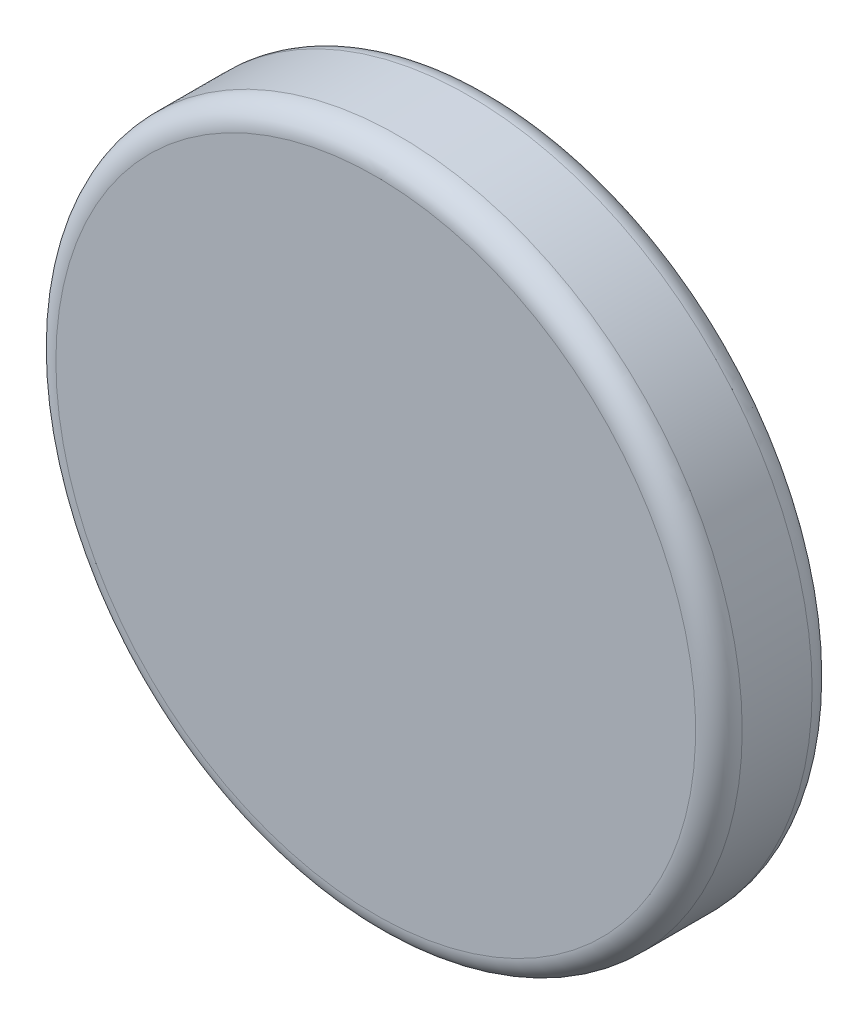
ISO-10303-21;
HEADER;
FILE_DESCRIPTION(('STEP AP214'),'2;1');
FILE_NAME('part.step','',(''),(''),'','','');
FILE_SCHEMA(('AUTOMOTIVE_DESIGN { 1 0 10303 214 1 1 1 1 }'));
ENDSEC;
DATA;
#1=APPLICATION_CONTEXT('core data for automotive mechanical design processes');
#2=APPLICATION_PROTOCOL_DEFINITION('international standard','automotive_design',2000,#1);
#3=PRODUCT_CONTEXT('',#1,'mechanical');
#4=PRODUCT('Part','Part','',(#3));
#5=PRODUCT_RELATED_PRODUCT_CATEGORY('part','',(#4));
#6=PRODUCT_DEFINITION_FORMATION('','',#4);
#7=PRODUCT_DEFINITION_CONTEXT('part definition',#1,'design');
#8=PRODUCT_DEFINITION('design','',#6,#7);
#9=PRODUCT_DEFINITION_SHAPE('','',#8);
#10=(LENGTH_UNIT() NAMED_UNIT(*) SI_UNIT(.MILLI.,.METRE.));
#11=(NAMED_UNIT(*) PLANE_ANGLE_UNIT() SI_UNIT($,.RADIAN.));
#12=(NAMED_UNIT(*) SI_UNIT($,.STERADIAN.) SOLID_ANGLE_UNIT());
#13=UNCERTAINTY_MEASURE_WITH_UNIT(LENGTH_MEASURE(1.E-05),#10,'distance_accuracy_value','');
#14=(GEOMETRIC_REPRESENTATION_CONTEXT(3) GLOBAL_UNCERTAINTY_ASSIGNED_CONTEXT((#13)) GLOBAL_UNIT_ASSIGNED_CONTEXT((#10,
#11,#12)) REPRESENTATION_CONTEXT('',''));
#15=CARTESIAN_POINT('',(0.,0.,0.));
#16=DIRECTION('',(0.,0.,1.));
#17=DIRECTION('',(1.,0.,0.));
#18=AXIS2_PLACEMENT_3D('',#15,#16,#17);
#19=CARTESIAN_POINT('',(0.,-32.2713973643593,76.8812492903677));
#20=DIRECTION('',(0.,0.,1.));
#21=DIRECTION('',(1.,0.,0.));
#22=AXIS2_PLACEMENT_3D('',#19,#20,#21);
#23=PLANE('',#22);
#24=CARTESIAN_POINT('',(0.,-32.2713973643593,76.8812492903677));
#25=DIRECTION('',(0.,0.,-1.));
#26=DIRECTION('',(-1.,0.,0.));
#27=AXIS2_PLACEMENT_3D('',#24,#25,#26);
#28=CIRCLE('',#27,13.4781530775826);
#29=CARTESIAN_POINT('',(13.4781530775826,-32.2713973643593,76.8812492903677));
#30=VERTEX_POINT('',#29);
#31=EDGE_CURVE('E73',#30,#30,#28,.T.);
#32=ORIENTED_EDGE('',*,*,#31,.T.);
#33=EDGE_LOOP('',(#32));
#34=FACE_BOUND('',#33,.T.);
#35=ADVANCED_FACE('F17',(#34),#23,.F.);
#36=CARTESIAN_POINT('',(0.,-32.2713973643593,78.8812492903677));
#37=DIRECTION('',(0.,0.,1.));
#38=DIRECTION('',(1.,0.,0.));
#39=AXIS2_PLACEMENT_3D('',#36,#37,#38);
#40=PLANE('',#39);
#41=CARTESIAN_POINT('',(0.,-32.2713973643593,78.8812492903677));
#42=DIRECTION('',(0.,0.,-1.));
#43=DIRECTION('',(-1.,0.,0.));
#44=AXIS2_PLACEMENT_3D('',#41,#42,#43);
#45=CIRCLE('',#44,13.7281530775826);
#46=CARTESIAN_POINT('',(-13.7281530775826,-32.2713973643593,78.8812492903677));
#47=VERTEX_POINT('',#46);
#48=EDGE_CURVE('E27',#47,#47,#45,.T.);
#49=ORIENTED_EDGE('',*,*,#48,.F.);
#50=EDGE_LOOP('',(#49));
#51=FACE_BOUND('',#50,.T.);
#52=ADVANCED_FACE('F19',(#51),#40,.T.);
#53=CARTESIAN_POINT('',(0.,-32.2713973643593,77.8812492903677));
#54=DIRECTION('',(0.,0.,1.));
#55=DIRECTION('',(1.,0.,0.));
#56=AXIS2_PLACEMENT_3D('',#53,#54,#55);
#57=TOROIDAL_SURFACE('',#56,13.7281530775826,1.);
#58=ORIENTED_EDGE('',*,*,#48,.T.);
#59=CARTESIAN_POINT('',(-13.7281530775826,-32.2713973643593,77.8812492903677));
#60=DIRECTION('',(0.,-1.,0.));
#61=DIRECTION('',(-1.,0.,0.));
#62=AXIS2_PLACEMENT_3D('',#59,#60,#61);
#63=CIRCLE('',#62,1.);
#64=CARTESIAN_POINT('',(-14.7281530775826,-32.2713973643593,77.8812492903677));
#65=VERTEX_POINT('',#64);
#66=EDGE_CURVE('E11',#47,#65,#63,.T.);
#67=ORIENTED_EDGE('',*,*,#66,.T.);
#68=CARTESIAN_POINT('',(0.,-32.2713973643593,77.8812492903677));
#69=DIRECTION('',(0.,0.,1.));
#70=DIRECTION('',(-1.,0.,0.));
#71=AXIS2_PLACEMENT_3D('',#68,#69,#70);
#72=CIRCLE('',#71,14.7281530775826);
#73=CARTESIAN_POINT('',(14.7281530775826,-32.2713973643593,77.8812492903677));
#74=VERTEX_POINT('',#73);
#75=EDGE_CURVE('E21',#65,#74,#72,.T.);
#76=ORIENTED_EDGE('',*,*,#75,.T.);
#77=CARTESIAN_POINT('',(0.,-32.2713973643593,77.8812492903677));
#78=DIRECTION('',(0.,0.,1.));
#79=DIRECTION('',(-1.,0.,0.));
#80=AXIS2_PLACEMENT_3D('',#77,#78,#79);
#81=CIRCLE('',#80,14.7281530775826);
#82=EDGE_CURVE('E100',#74,#65,#81,.T.);
#83=ORIENTED_EDGE('',*,*,#82,.T.);
#84=ORIENTED_EDGE('',*,*,#66,.F.);
#85=EDGE_LOOP('',(#58,#67,#76,#83,#84));
#86=FACE_BOUND('',#85,.T.);
#87=ADVANCED_FACE('F156',(#86),#57,.T.);
#88=CARTESIAN_POINT('',(0.,-32.2713973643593,76.8812492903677));
#89=DIRECTION('',(0.,0.,-1.));
#90=DIRECTION('',(-1.,0.,0.));
#91=AXIS2_PLACEMENT_3D('',#88,#89,#90);
#92=CYLINDRICAL_SURFACE('',#91,14.7281530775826);
#93=CARTESIAN_POINT('',(0.,-32.2713973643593,74.8812492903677));
#94=DIRECTION('',(0.,0.,-1.));
#95=DIRECTION('',(-1.,0.,0.));
#96=AXIS2_PLACEMENT_3D('',#93,#94,#95);
#97=CIRCLE('',#96,14.7281530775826);
#98=CARTESIAN_POINT('',(14.7281530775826,-32.2713973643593,74.8812492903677));
#99=VERTEX_POINT('',#98);
#100=EDGE_CURVE('E86',#99,#99,#97,.T.);
#101=ORIENTED_EDGE('',*,*,#100,.F.);
#102=DIRECTION('',(0.,0.,1.));
#103=VECTOR('',#102,1.);
#104=CARTESIAN_POINT('',(14.7281530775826,-32.2713973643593,76.8812492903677));
#105=LINE('',#104,#103);
#106=EDGE_CURVE('E90',#99,#74,#105,.T.);
#107=ORIENTED_EDGE('',*,*,#106,.T.);
#108=ORIENTED_EDGE('',*,*,#75,.F.);
#109=ORIENTED_EDGE('',*,*,#82,.F.);
#110=ORIENTED_EDGE('',*,*,#106,.F.);
#111=EDGE_LOOP('',(#101,#107,#108,#109,#110));
#112=FACE_BOUND('',#111,.T.);
#113=ADVANCED_FACE('F149',(#112),#92,.T.);
#114=CARTESIAN_POINT('',(0.,-32.2713973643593,74.8812492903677));
#115=DIRECTION('',(0.,0.,-1.));
#116=DIRECTION('',(-1.,0.,0.));
#117=AXIS2_PLACEMENT_3D('',#114,#115,#116);
#118=TOROIDAL_SURFACE('',#117,13.7281530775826,1.);
#119=CARTESIAN_POINT('',(0.,-32.2713973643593,73.8812492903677));
#120=DIRECTION('',(0.,0.,1.));
#121=DIRECTION('',(-1.,0.,0.));
#122=AXIS2_PLACEMENT_3D('',#119,#120,#121);
#123=CIRCLE('',#122,13.7281530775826);
#124=CARTESIAN_POINT('',(13.7281530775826,-32.2713973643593,73.8812492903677));
#125=VERTEX_POINT('',#124);
#126=CARTESIAN_POINT('',(-13.7281530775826,-32.2713973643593,73.8812492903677));
#127=VERTEX_POINT('',#126);
#128=EDGE_CURVE('E111',#125,#127,#123,.T.);
#129=ORIENTED_EDGE('',*,*,#128,.T.);
#130=CARTESIAN_POINT('',(0.,-32.2713973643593,73.8812492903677));
#131=DIRECTION('',(0.,0.,1.));
#132=DIRECTION('',(-1.,0.,0.));
#133=AXIS2_PLACEMENT_3D('',#130,#131,#132);
#134=CIRCLE('',#133,13.7281530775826);
#135=EDGE_CURVE('E88',#127,#125,#134,.T.);
#136=ORIENTED_EDGE('',*,*,#135,.T.);
#137=CARTESIAN_POINT('',(13.7281530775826,-32.2713973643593,74.8812492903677));
#138=DIRECTION('',(0.,-1.,0.));
#139=DIRECTION('',(1.,0.,0.));
#140=AXIS2_PLACEMENT_3D('',#137,#138,#139);
#141=CIRCLE('',#140,1.);
#142=EDGE_CURVE('E77',#125,#99,#141,.T.);
#143=ORIENTED_EDGE('',*,*,#142,.T.);
#144=ORIENTED_EDGE('',*,*,#100,.T.);
#145=ORIENTED_EDGE('',*,*,#142,.F.);
#146=EDGE_LOOP('',(#129,#136,#143,#144,#145));
#147=FACE_BOUND('',#146,.T.);
#148=ADVANCED_FACE('F141',(#147),#118,.T.);
#149=CARTESIAN_POINT('',(0.,-32.2713973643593,76.8812492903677));
#150=DIRECTION('',(0.,0.,-1.));
#151=DIRECTION('',(-1.,0.,0.));
#152=AXIS2_PLACEMENT_3D('',#149,#150,#151);
#153=CYLINDRICAL_SURFACE('',#152,13.4781530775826);
#154=CARTESIAN_POINT('',(0.,-32.2713973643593,74.5426871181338));
#155=DIRECTION('',(0.,0.,1.));
#156=DIRECTION('',(1.,0.,0.));
#157=AXIS2_PLACEMENT_3D('',#154,#155,#156);
#158=CIRCLE('',#157,13.4781530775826);
#159=CARTESIAN_POINT('',(-13.4781530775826,-32.2713973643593,74.5426871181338));
#160=VERTEX_POINT('',#159);
#161=CARTESIAN_POINT('',(13.4781530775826,-32.2713973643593,74.5426871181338));
#162=VERTEX_POINT('',#161);
#163=EDGE_CURVE('E128',#160,#162,#158,.T.);
#164=ORIENTED_EDGE('',*,*,#163,.F.);
#165=CARTESIAN_POINT('',(0.,-32.2713973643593,74.5426871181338));
#166=DIRECTION('',(0.,0.,1.));
#167=DIRECTION('',(1.,0.,0.));
#168=AXIS2_PLACEMENT_3D('',#165,#166,#167);
#169=CIRCLE('',#168,13.4781530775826);
#170=EDGE_CURVE('E122',#162,#160,#169,.T.);
#171=ORIENTED_EDGE('',*,*,#170,.F.);
#172=DIRECTION('',(0.,0.,1.));
#173=VECTOR('',#172,1.);
#174=CARTESIAN_POINT('',(13.4781530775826,-32.2713973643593,76.8812492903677));
#175=LINE('',#174,#173);
#176=EDGE_CURVE('E78',#162,#30,#175,.T.);
#177=ORIENTED_EDGE('',*,*,#176,.T.);
#178=ORIENTED_EDGE('',*,*,#31,.F.);
#179=ORIENTED_EDGE('',*,*,#176,.F.);
#180=EDGE_LOOP('',(#164,#171,#177,#178,#179));
#181=FACE_BOUND('',#180,.T.);
#182=ADVANCED_FACE('F139',(#181),#153,.F.);
#183=CARTESIAN_POINT('',(0.,-32.2713973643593,74.5426871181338));
#184=DIRECTION('',(0.,0.,-1.));
#185=DIRECTION('',(1.,0.,0.));
#186=AXIS2_PLACEMENT_3D('',#183,#184,#185);
#187=TOROIDAL_SURFACE('',#186,14.4781530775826,1.);
#188=ORIENTED_EDGE('',*,*,#163,.T.);
#189=ORIENTED_EDGE('',*,*,#170,.T.);
#190=CARTESIAN_POINT('',(-14.4781530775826,-32.2713973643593,74.5426871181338));
#191=DIRECTION('',(0.,1.,0.));
#192=DIRECTION('',(-1.,0.,0.));
#193=AXIS2_PLACEMENT_3D('',#190,#191,#192);
#194=CIRCLE('',#193,1.);
#195=EDGE_CURVE('E117',#160,#127,#194,.T.);
#196=ORIENTED_EDGE('',*,*,#195,.T.);
#197=ORIENTED_EDGE('',*,*,#128,.F.);
#198=ORIENTED_EDGE('',*,*,#135,.F.);
#199=ORIENTED_EDGE('',*,*,#195,.F.);
#200=EDGE_LOOP('',(#188,#189,#196,#197,#198,#199));
#201=FACE_BOUND('',#200,.T.);
#202=ADVANCED_FACE('F137',(#201),#187,.T.);
#203=CLOSED_SHELL('',(#35,#52,#87,#113,#148,#182,#202));
#204=MANIFOLD_SOLID_BREP('B1',#203);
#205=ADVANCED_BREP_SHAPE_REPRESENTATION('',(#18,#204),#14);
#206=SHAPE_DEFINITION_REPRESENTATION(#9,#205);
ENDSEC;
END-ISO-10303-21;
